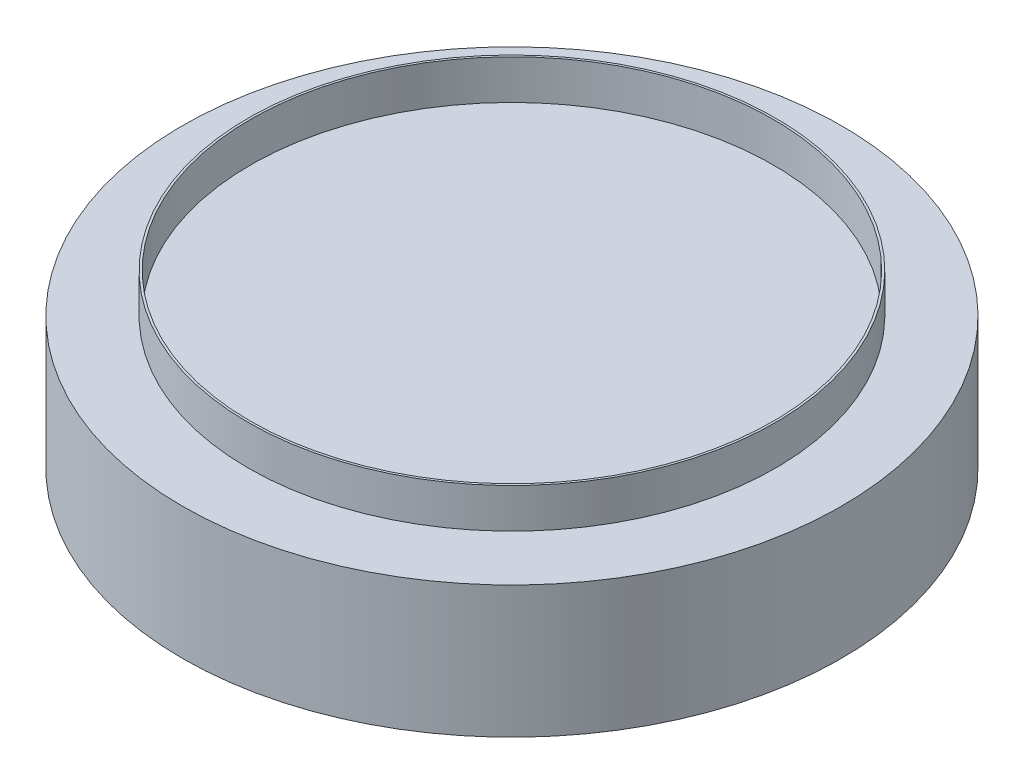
ISO-10303-21;
HEADER;
FILE_DESCRIPTION(('STEP AP214'),'2;1');
FILE_NAME('part.step','',(''),(''),'','','');
FILE_SCHEMA(('AUTOMOTIVE_DESIGN { 1 0 10303 214 1 1 1 1 }'));
ENDSEC;
DATA;
#1=APPLICATION_CONTEXT('core data for automotive mechanical design processes');
#2=APPLICATION_PROTOCOL_DEFINITION('international standard','automotive_design',2000,#1);
#3=PRODUCT_CONTEXT('',#1,'mechanical');
#4=PRODUCT('Part','Part','',(#3));
#5=PRODUCT_RELATED_PRODUCT_CATEGORY('part','',(#4));
#6=PRODUCT_DEFINITION_FORMATION('','',#4);
#7=PRODUCT_DEFINITION_CONTEXT('part definition',#1,'design');
#8=PRODUCT_DEFINITION('design','',#6,#7);
#9=PRODUCT_DEFINITION_SHAPE('','',#8);
#10=(LENGTH_UNIT() NAMED_UNIT(*) SI_UNIT(.MILLI.,.METRE.));
#11=(NAMED_UNIT(*) PLANE_ANGLE_UNIT() SI_UNIT($,.RADIAN.));
#12=(NAMED_UNIT(*) SI_UNIT($,.STERADIAN.) SOLID_ANGLE_UNIT());
#13=UNCERTAINTY_MEASURE_WITH_UNIT(LENGTH_MEASURE(1.E-05),#10,'distance_accuracy_value','');
#14=(GEOMETRIC_REPRESENTATION_CONTEXT(3) GLOBAL_UNCERTAINTY_ASSIGNED_CONTEXT((#13)) GLOBAL_UNIT_ASSIGNED_CONTEXT((#10,
#11,#12)) REPRESENTATION_CONTEXT('',''));
#15=CARTESIAN_POINT('',(0.,0.,0.));
#16=DIRECTION('',(0.,0.,1.));
#17=DIRECTION('',(1.,0.,0.));
#18=AXIS2_PLACEMENT_3D('',#15,#16,#17);
#19=CARTESIAN_POINT('',(0.,60.,0.));
#20=DIRECTION('',(0.,-1.,0.));
#21=DIRECTION('',(0.,0.,-1.));
#22=AXIS2_PLACEMENT_3D('',#19,#20,#21);
#23=CYLINDRICAL_SURFACE('',#22,150.);
#24=CARTESIAN_POINT('',(0.,60.,0.));
#25=DIRECTION('',(0.,1.,0.));
#26=DIRECTION('',(0.,0.,1.));
#27=AXIS2_PLACEMENT_3D('',#24,#25,#26);
#28=CIRCLE('',#27,150.);
#29=CARTESIAN_POINT('',(0.,60.,150.));
#30=VERTEX_POINT('',#29);
#31=EDGE_CURVE('E50',#30,#30,#28,.T.);
#32=ORIENTED_EDGE('',*,*,#31,.F.);
#33=EDGE_LOOP('',(#32));
#34=FACE_BOUND('',#33,.T.);
#35=CARTESIAN_POINT('',(0.,0.,0.));
#36=DIRECTION('',(0.,1.,0.));
#37=DIRECTION('',(0.,0.,1.));
#38=AXIS2_PLACEMENT_3D('',#35,#36,#37);
#39=CIRCLE('',#38,150.);
#40=CARTESIAN_POINT('',(0.,0.,150.));
#41=VERTEX_POINT('',#40);
#42=EDGE_CURVE('E56',#41,#41,#39,.T.);
#43=ORIENTED_EDGE('',*,*,#42,.T.);
#44=EDGE_LOOP('',(#43));
#45=FACE_BOUND('',#44,.T.);
#46=ADVANCED_FACE('F37',(#34,#45),#23,.T.);
#47=CARTESIAN_POINT('',(0.,60.,0.));
#48=DIRECTION('',(0.,1.,0.));
#49=DIRECTION('',(0.,0.,1.));
#50=AXIS2_PLACEMENT_3D('',#47,#48,#49);
#51=PLANE('',#50);
#52=CARTESIAN_POINT('',(0.,60.,0.));
#53=DIRECTION('',(0.,1.,0.));
#54=DIRECTION('',(0.,0.,1.));
#55=AXIS2_PLACEMENT_3D('',#52,#53,#54);
#56=CIRCLE('',#55,120.);
#57=CARTESIAN_POINT('',(0.,60.,120.));
#58=VERTEX_POINT('',#57);
#59=EDGE_CURVE('E45',#58,#58,#56,.T.);
#60=ORIENTED_EDGE('',*,*,#59,.F.);
#61=EDGE_LOOP('',(#60));
#62=FACE_BOUND('',#61,.T.);
#63=ORIENTED_EDGE('',*,*,#31,.T.);
#64=EDGE_LOOP('',(#63));
#65=FACE_BOUND('',#64,.T.);
#66=ADVANCED_FACE('F112',(#62,#65),#51,.T.);
#67=CARTESIAN_POINT('',(0.,0.,0.));
#68=DIRECTION('',(0.,1.,0.));
#69=DIRECTION('',(0.,0.,1.));
#70=AXIS2_PLACEMENT_3D('',#67,#68,#69);
#71=PLANE('',#70);
#72=CARTESIAN_POINT('',(0.,0.,0.));
#73=DIRECTION('',(0.,-1.,0.));
#74=DIRECTION('',(0.,0.,-1.));
#75=AXIS2_PLACEMENT_3D('',#72,#73,#74);
#76=CIRCLE('',#75,145.);
#77=CARTESIAN_POINT('',(0.,0.,-145.));
#78=VERTEX_POINT('',#77);
#79=EDGE_CURVE('E80',#78,#78,#76,.T.);
#80=ORIENTED_EDGE('',*,*,#79,.F.);
#81=EDGE_LOOP('',(#80));
#82=FACE_BOUND('',#81,.T.);
#83=ORIENTED_EDGE('',*,*,#42,.F.);
#84=EDGE_LOOP('',(#83));
#85=FACE_BOUND('',#84,.T.);
#86=ADVANCED_FACE('F108',(#82,#85),#71,.F.);
#87=CARTESIAN_POINT('',(0.,78.,0.));
#88=DIRECTION('',(0.,-1.,0.));
#89=DIRECTION('',(0.,0.,-1.));
#90=AXIS2_PLACEMENT_3D('',#87,#88,#89);
#91=CYLINDRICAL_SURFACE('',#90,120.);
#92=CARTESIAN_POINT('',(0.,78.,0.));
#93=DIRECTION('',(0.,1.,0.));
#94=DIRECTION('',(0.,0.,1.));
#95=AXIS2_PLACEMENT_3D('',#92,#93,#94);
#96=CIRCLE('',#95,120.);
#97=CARTESIAN_POINT('',(0.,78.,120.));
#98=VERTEX_POINT('',#97);
#99=EDGE_CURVE('E59',#98,#98,#96,.T.);
#100=ORIENTED_EDGE('',*,*,#99,.F.);
#101=EDGE_LOOP('',(#100));
#102=FACE_BOUND('',#101,.T.);
#103=ORIENTED_EDGE('',*,*,#59,.T.);
#104=EDGE_LOOP('',(#103));
#105=FACE_BOUND('',#104,.T.);
#106=ADVANCED_FACE('F111',(#102,#105),#91,.T.);
#107=CARTESIAN_POINT('',(0.,78.,0.));
#108=DIRECTION('',(0.,1.,0.));
#109=DIRECTION('',(0.,0.,1.));
#110=AXIS2_PLACEMENT_3D('',#107,#108,#109);
#111=PLANE('',#110);
#112=CARTESIAN_POINT('',(0.,78.,0.));
#113=DIRECTION('',(0.,1.,0.));
#114=DIRECTION('',(0.,0.,1.));
#115=AXIS2_PLACEMENT_3D('',#112,#113,#114);
#116=CIRCLE('',#115,119.);
#117=CARTESIAN_POINT('',(0.,78.,119.));
#118=VERTEX_POINT('',#117);
#119=EDGE_CURVE('E72',#118,#118,#116,.T.);
#120=ORIENTED_EDGE('',*,*,#119,.F.);
#121=EDGE_LOOP('',(#120));
#122=FACE_BOUND('',#121,.T.);
#123=ORIENTED_EDGE('',*,*,#99,.T.);
#124=EDGE_LOOP('',(#123));
#125=FACE_BOUND('',#124,.T.);
#126=ADVANCED_FACE('F118',(#122,#125),#111,.T.);
#127=CARTESIAN_POINT('',(0.,60.,0.));
#128=DIRECTION('',(0.,1.,0.));
#129=DIRECTION('',(0.,0.,1.));
#130=AXIS2_PLACEMENT_3D('',#127,#128,#129);
#131=CYLINDRICAL_SURFACE('',#130,119.);
#132=CARTESIAN_POINT('',(0.,60.,0.));
#133=DIRECTION('',(0.,1.,0.));
#134=DIRECTION('',(0.,0.,1.));
#135=AXIS2_PLACEMENT_3D('',#132,#133,#134);
#136=CIRCLE('',#135,119.);
#137=CARTESIAN_POINT('',(0.,60.,119.));
#138=VERTEX_POINT('',#137);
#139=EDGE_CURVE('E67',#138,#138,#136,.T.);
#140=ORIENTED_EDGE('',*,*,#139,.F.);
#141=EDGE_LOOP('',(#140));
#142=FACE_BOUND('',#141,.T.);
#143=ORIENTED_EDGE('',*,*,#119,.T.);
#144=EDGE_LOOP('',(#143));
#145=FACE_BOUND('',#144,.T.);
#146=ADVANCED_FACE('F149',(#142,#145),#131,.F.);
#147=CARTESIAN_POINT('',(0.,60.,0.));
#148=DIRECTION('',(0.,1.,0.));
#149=DIRECTION('',(0.,0.,1.));
#150=AXIS2_PLACEMENT_3D('',#147,#148,#149);
#151=PLANE('',#150);
#152=ORIENTED_EDGE('',*,*,#139,.T.);
#153=EDGE_LOOP('',(#152));
#154=FACE_BOUND('',#153,.T.);
#155=ADVANCED_FACE('F104',(#154),#151,.T.);
#156=CARTESIAN_POINT('',(0.,15.,0.));
#157=DIRECTION('',(0.,-1.,0.));
#158=DIRECTION('',(0.,0.,-1.));
#159=AXIS2_PLACEMENT_3D('',#156,#157,#158);
#160=CYLINDRICAL_SURFACE('',#159,145.);
#161=CARTESIAN_POINT('',(0.,15.,0.));
#162=DIRECTION('',(0.,-1.,0.));
#163=DIRECTION('',(0.,0.,-1.));
#164=AXIS2_PLACEMENT_3D('',#161,#162,#163);
#165=CIRCLE('',#164,145.);
#166=CARTESIAN_POINT('',(0.,15.,-145.));
#167=VERTEX_POINT('',#166);
#168=EDGE_CURVE('E78',#167,#167,#165,.T.);
#169=ORIENTED_EDGE('',*,*,#168,.F.);
#170=EDGE_LOOP('',(#169));
#171=FACE_BOUND('',#170,.T.);
#172=ORIENTED_EDGE('',*,*,#79,.T.);
#173=EDGE_LOOP('',(#172));
#174=FACE_BOUND('',#173,.T.);
#175=ADVANCED_FACE('F98',(#171,#174),#160,.F.);
#176=CARTESIAN_POINT('',(0.,15.,0.));
#177=DIRECTION('',(0.,-1.,0.));
#178=DIRECTION('',(0.,0.,-1.));
#179=AXIS2_PLACEMENT_3D('',#176,#177,#178);
#180=PLANE('',#179);
#181=CARTESIAN_POINT('',(0.,15.,0.));
#182=DIRECTION('',(0.,-1.,0.));
#183=DIRECTION('',(0.,0.,-1.));
#184=AXIS2_PLACEMENT_3D('',#181,#182,#183);
#185=CIRCLE('',#184,125.);
#186=CARTESIAN_POINT('',(0.,15.,-125.));
#187=VERTEX_POINT('',#186);
#188=EDGE_CURVE('E84',#187,#187,#185,.T.);
#189=ORIENTED_EDGE('',*,*,#188,.F.);
#190=EDGE_LOOP('',(#189));
#191=FACE_BOUND('',#190,.T.);
#192=ORIENTED_EDGE('',*,*,#168,.T.);
#193=EDGE_LOOP('',(#192));
#194=FACE_BOUND('',#193,.T.);
#195=ADVANCED_FACE('F94',(#191,#194),#180,.T.);
#196=CARTESIAN_POINT('',(0.,10.,0.));
#197=DIRECTION('',(0.,-1.,0.));
#198=DIRECTION('',(0.,0.,-1.));
#199=AXIS2_PLACEMENT_3D('',#196,#197,#198);
#200=PLANE('',#199);
#201=CARTESIAN_POINT('',(0.,10.,0.));
#202=DIRECTION('',(0.,-1.,0.));
#203=DIRECTION('',(0.,0.,-1.));
#204=AXIS2_PLACEMENT_3D('',#201,#202,#203);
#205=CIRCLE('',#204,116.339745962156);
#206=CARTESIAN_POINT('',(0.,10.,-116.339745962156));
#207=VERTEX_POINT('',#206);
#208=EDGE_CURVE('E10',#207,#207,#205,.T.);
#209=ORIENTED_EDGE('',*,*,#208,.T.);
#210=EDGE_LOOP('',(#209));
#211=FACE_BOUND('',#210,.T.);
#212=ADVANCED_FACE('F97',(#211),#200,.T.);
#213=CARTESIAN_POINT('',(0.,20.,0.));
#214=DIRECTION('',(0.,1.,0.));
#215=DIRECTION('',(0.,0.,1.));
#216=AXIS2_PLACEMENT_3D('',#213,#214,#215);
#217=TOROIDAL_SURFACE('',#216,116.339745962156,10.);
#218=ORIENTED_EDGE('',*,*,#188,.T.);
#219=EDGE_LOOP('',(#218));
#220=FACE_BOUND('',#219,.T.);
#221=ORIENTED_EDGE('',*,*,#208,.F.);
#222=EDGE_LOOP('',(#221));
#223=FACE_BOUND('',#222,.T.);
#224=ADVANCED_FACE('F39',(#220,#223),#217,.T.);
#225=CLOSED_SHELL('',(#46,#66,#86,#106,#126,#146,#155,#175,#195,#212,#224));
#226=MANIFOLD_SOLID_BREP('B2',#225);
#227=ADVANCED_BREP_SHAPE_REPRESENTATION('',(#18,#226),#14);
#228=SHAPE_DEFINITION_REPRESENTATION(#9,#227);
ENDSEC;
END-ISO-10303-21;
